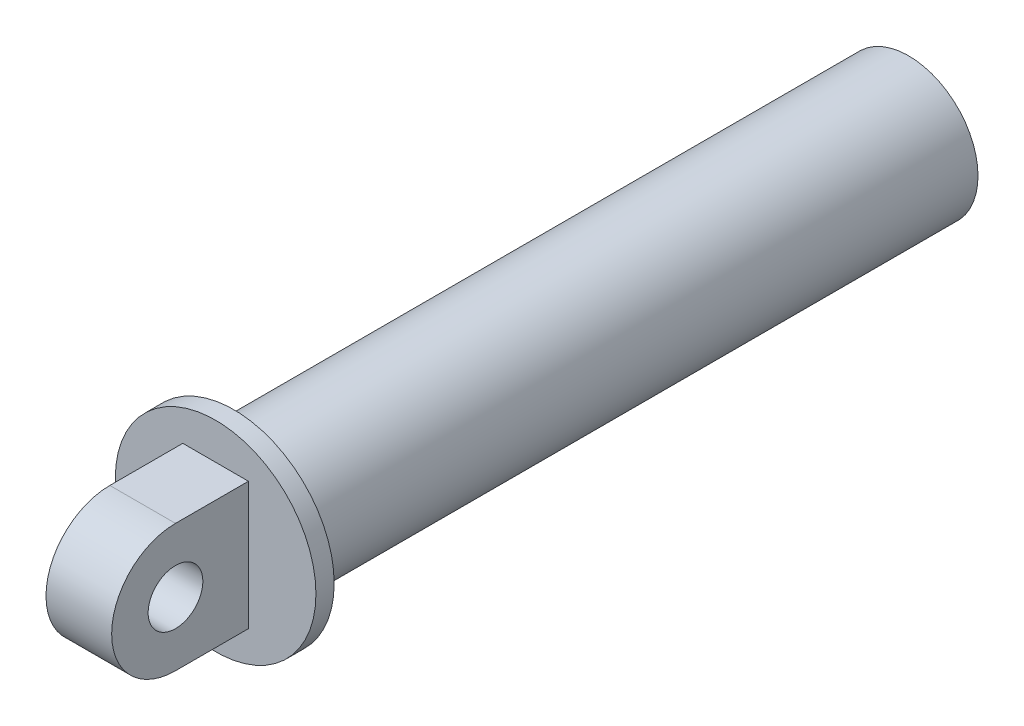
from build123d import *

# Parameters (mm, degrees)
SKETCH_1_R      = 38
SKETCH_1_R_2    = 30
EXTRUDE_1_DEPTH = 370
SKETCH_2_R      = 55
EXTRUDE_2_DEPTH = 10
SKETCH_3_R      = 15
EXTRUDE_3_DEPTH = 18
EXTRUDE_START   = 20
SKETCH_4_R      = 30
EXTRUDE_4_DEPTH = 20


with BuildPart() as part:
    # Sketch 1 → Extrude 1 (new body)
    with BuildSketch(Plane.XY):
        Circle(SKETCH_1_R)
        Circle(SKETCH_1_R_2, mode=Mode.SUBTRACT)
    extrude(amount=EXTRUDE_1_DEPTH)

    # Sketch 2 → Extrude 2 (add)
    with BuildSketch(Plane.XY.offset(370)):
        Circle(SKETCH_2_R)
    extrude(amount=EXTRUDE_2_DEPTH)

    # Sketch 3 → Extrude 3 (add, symmetric)
    with BuildSketch(Plane(origin=(0, 0, 0), x_dir=(0, 0, -1), z_dir=(1, 0, 0))):
        with BuildLine():
            Line((-420, 35), (-380, 35))
            Line((-380, 35), (-380, -35))
            Line((-380, -35), (-420, -35))
            ThreePointArc((-420, -35), (-455, 0), (-420, 35))
        make_face()
        with Locations((-420, 0)):
            Circle(SKETCH_3_R, mode=Mode.SUBTRACT)
    extrude(amount=EXTRUDE_3_DEPTH, both=True)

    # Sketch 4 → Extrude 4 (add)
    with BuildSketch(Plane(origin=(0, 0, 370), x_dir=(-1, 0, 0), z_dir=(0, 0, -1)).offset(EXTRUDE_START)):
        Circle(SKETCH_4_R)
    extrude(amount=-EXTRUDE_4_DEPTH)


solid = part.part
